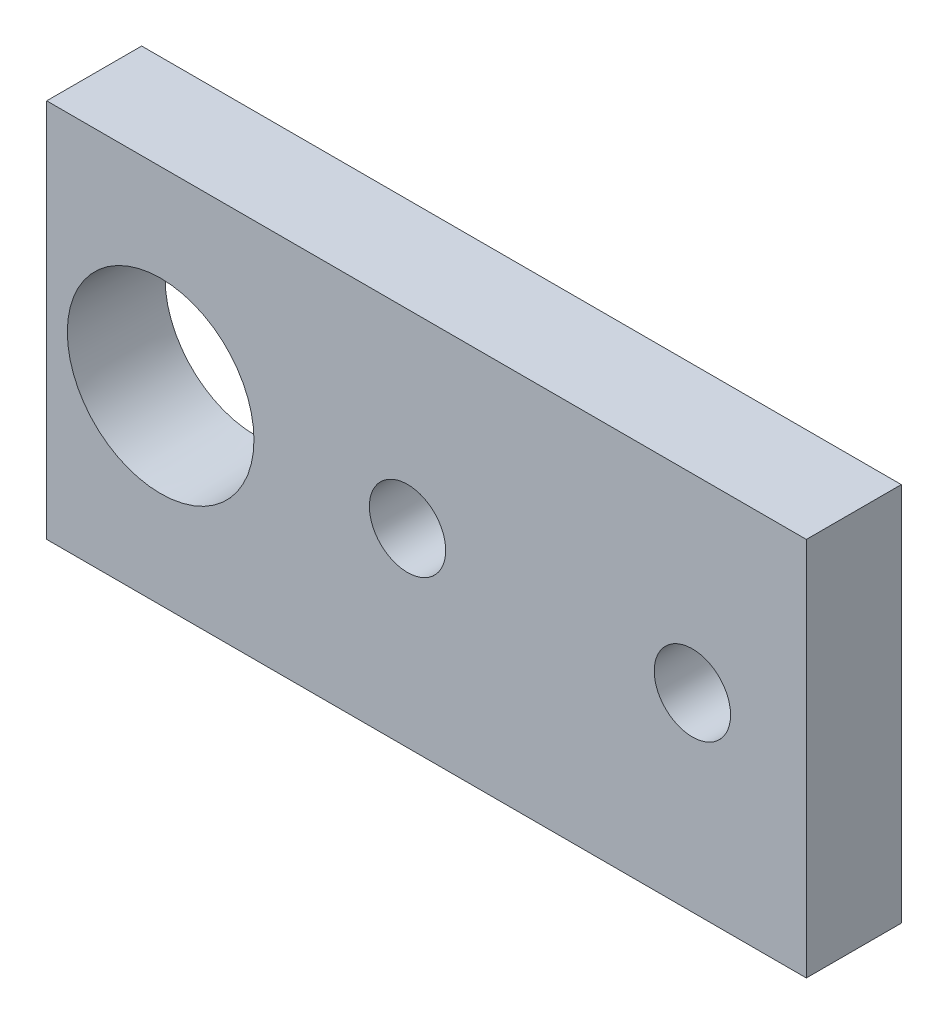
from build123d import *

# Parameters (mm, degrees)
SKETCH1_W          = 50.8
SKETCH1_H          = 25.4
EXTRUDE1_DEPTH     = 6.35
SKETCH3_R          = 2.5527
CUT_EXTRUDE2_DEPTH = 58.15


with BuildPart() as part:
    # Sketch1 → Extrude1 (new body)
    with BuildSketch(Plane.XY):
        with Locations((25.4, 12.7)):
            Rectangle(SKETCH1_W, SKETCH1_H)
    extrude(amount=EXTRUDE1_DEPTH)

    # Sketch3 → Cut-Extrude2 (cut, through all)
    with BuildSketch(Plane.XY.offset(6.35)):
        with Locations((24.13, 12.7)):
            Circle(SKETCH3_R)
        with Locations((43.18, 12.7)):
            Circle(SKETCH3_R)
    extrude(amount=-CUT_EXTRUDE2_DEPTH, mode=Mode.SUBTRACT)

    # Sketch4 → 1_4 NPT Tapped Hole1 (revolve, cut)
    with BuildSketch(Plane(origin=(7.62, 12.7, 6.35), x_dir=(0, -1, 0), z_dir=(1, 0, 0))):
        Polygon((0, 0), (0, 6.35), (5.5626, 6.35), (5.5626, 9.906), (5.943685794, 9.906), (6.2402847, 0), align=None)
    revolve(axis=Axis((7.62, 12.7, 12.7), (0, 0, -1)), mode=Mode.SUBTRACT)


solid = part.part
